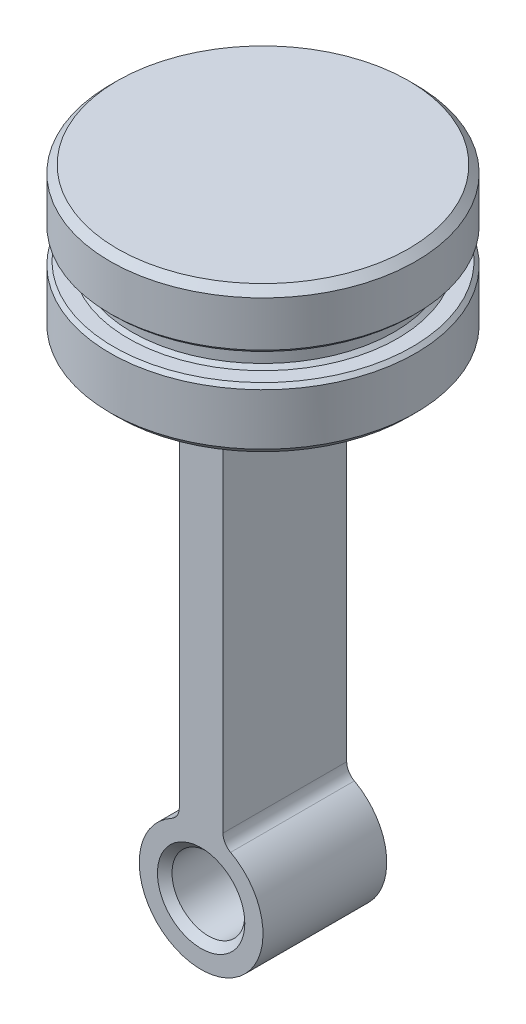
from build123d import *

# Parameters (mm, degrees)
BASE_EXTRUSION_DEPTH    = 8.5
ESQUISSE2_R             = 2.5
ENL_V_MAT_EXTRU_1_DEPTH = 33.902317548
CONG_1_R                = 1
CHANFREIN1_SIZE         = 0.5
ESQUISSE3_R             = 10.5
BOSS_EXTRU_1_DEPTH      = 10
CONG_2_R                = 1
CHANFREIN2_SIZE         = 0.5
ESQUISSE5_W             = 1.5
ESQUISSE5_H             = 1.850798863
CHANFREIN3_SIZE         = 0.25


with BuildPart() as part:
    # Esquisse1 → Base-Extrusion (new body)
    with BuildSketch(Plane.XY):
        with BuildLine():
            Line((-1.5, 31.5), (-1.5, 3.97649343))
            ThreePointArc((-1.5, 3.97649343), (0, -4.25), (1.5, 3.97649343))
            Line((1.5, 3.97649343), (1.5, 31.5))
            Line((1.5, 31.5), (-1.5, 31.5))
        make_face()
    extrude(amount=-BASE_EXTRUSION_DEPTH)

    # Esquisse2 → Enl_v. mat.-Extru.1 (cut, through all)
    with BuildSketch(Plane.XY):
        Circle(ESQUISSE2_R)
    extrude(amount=-ENL_V_MAT_EXTRU_1_DEPTH, mode=Mode.SUBTRACT)

    # Cong_1
    cong_1_edges = [part.edges().sort_by_distance(p)[0] for p in [
        (1.5, 3.97649343, -4.25),
        (-1.5, 3.97649343, -4.25),
    ]]
    fillet(cong_1_edges, radius=CONG_1_R)

    # Chanfrein1
    chanfrein1_edges = [part.edges().sort_by_distance(p)[0] for p in [
        (-2.5, 0, -8.5),
        (-2.5, 0, 0),
    ]]
    chamfer(chanfrein1_edges, length=CHANFREIN1_SIZE)

    # Esquisse3 → Boss.-Extru.1 (add)
    with BuildSketch(Plane(origin=(0, 31.5, 0), x_dir=(1, 0, 0), z_dir=(0, 1, 0))):
        with Locations(Location((0, 4.25, 0), (0, 0, 270))):
            Circle(ESQUISSE3_R)
    extrude(amount=BOSS_EXTRU_1_DEPTH)

    # Cong_2
    cong_2_edges = [part.edges().sort_by_distance(p)[0] for p in [
        (0, 31.5, -8.5),
        (0, 31.5, 0),
        (1.5, 31.5, -4.25),
        (-1.5, 31.5, -4.25),
    ]]
    fillet(cong_2_edges, radius=CONG_2_R)

    # Chanfrein2
    chanfrein2_edges = [part.edges().sort_by_distance(p)[0] for p in [
        (0, 31.5, -14.75),
        (0, 41.5, -14.75),
    ]]
    chamfer(chanfrein2_edges, length=CHANFREIN2_SIZE)

    # Esquisse5 → Enl_vement de mati_re-R_volution1 (revolve, cut)
    with BuildSketch(Plane(origin=(0, 0, 0), x_dir=(0, 0, -1), z_dir=(1, 0, 0))):
        with Locations((-5.5, 36.71512237)):
            Rectangle(ESQUISSE5_W, ESQUISSE5_H)
    revolve(axis=Axis((0, 41, -4.25), (0, -1, 0)), mode=Mode.SUBTRACT)

    # Chanfrein3
    chanfrein3_edges = [part.edges().sort_by_distance(p)[0] for p in [
        (0, 35.789722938, -14.75),
        (0, 37.640521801, -14.75),
        (0, 37.640521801, -13.25),
        (0, 35.789722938, -13.25),
    ]]
    chamfer(chanfrein3_edges, length=CHANFREIN3_SIZE)


solid = part.part
